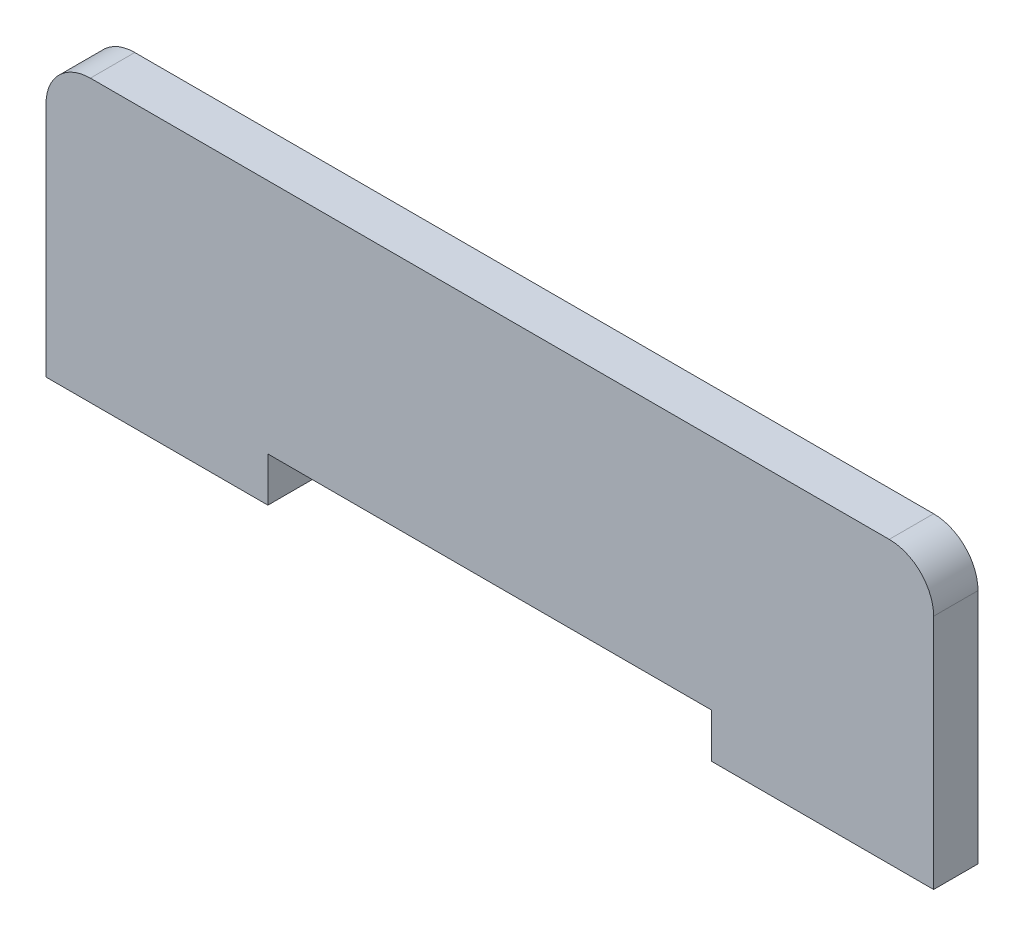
ISO-10303-21;
HEADER;
FILE_DESCRIPTION(('STEP AP214'),'2;1');
FILE_NAME('part.step','',(''),(''),'','','');
FILE_SCHEMA(('AUTOMOTIVE_DESIGN { 1 0 10303 214 1 1 1 1 }'));
ENDSEC;
DATA;
#1=APPLICATION_CONTEXT('core data for automotive mechanical design processes');
#2=APPLICATION_PROTOCOL_DEFINITION('international standard','automotive_design',2000,#1);
#3=PRODUCT_CONTEXT('',#1,'mechanical');
#4=PRODUCT('Part','Part','',(#3));
#5=PRODUCT_RELATED_PRODUCT_CATEGORY('part','',(#4));
#6=PRODUCT_DEFINITION_FORMATION('','',#4);
#7=PRODUCT_DEFINITION_CONTEXT('part definition',#1,'design');
#8=PRODUCT_DEFINITION('design','',#6,#7);
#9=PRODUCT_DEFINITION_SHAPE('','',#8);
#10=(LENGTH_UNIT() NAMED_UNIT(*) SI_UNIT(.MILLI.,.METRE.));
#11=(NAMED_UNIT(*) PLANE_ANGLE_UNIT() SI_UNIT($,.RADIAN.));
#12=(NAMED_UNIT(*) SI_UNIT($,.STERADIAN.) SOLID_ANGLE_UNIT());
#13=UNCERTAINTY_MEASURE_WITH_UNIT(LENGTH_MEASURE(1.E-05),#10,'distance_accuracy_value','');
#14=(GEOMETRIC_REPRESENTATION_CONTEXT(3) GLOBAL_UNCERTAINTY_ASSIGNED_CONTEXT((#13)) GLOBAL_UNIT_ASSIGNED_CONTEXT((#10,
#11,#12)) REPRESENTATION_CONTEXT('',''));
#15=CARTESIAN_POINT('',(0.,0.,0.));
#16=DIRECTION('',(0.,0.,1.));
#17=DIRECTION('',(1.,0.,0.));
#18=AXIS2_PLACEMENT_3D('',#15,#16,#17);
#19=CARTESIAN_POINT('',(0.,0.,3.));
#20=DIRECTION('',(0.,1.,0.));
#21=DIRECTION('',(0.,0.,1.));
#22=AXIS2_PLACEMENT_3D('',#19,#20,#21);
#23=PLANE('',#22);
#24=DIRECTION('',(1.,0.,0.));
#25=VECTOR('',#24,1.);
#26=CARTESIAN_POINT('',(0.,0.,0.));
#27=LINE('',#26,#25);
#28=CARTESIAN_POINT('',(0.,0.,0.));
#29=VERTEX_POINT('',#28);
#30=CARTESIAN_POINT('',(15.,0.,0.));
#31=VERTEX_POINT('',#30);
#32=EDGE_CURVE('E201',#29,#31,#27,.T.);
#33=ORIENTED_EDGE('',*,*,#32,.T.);
#34=DIRECTION('',(0.,0.,-1.));
#35=VECTOR('',#34,1.);
#36=CARTESIAN_POINT('',(15.,0.,3.));
#37=LINE('',#36,#35);
#38=CARTESIAN_POINT('',(15.,0.,3.));
#39=VERTEX_POINT('',#38);
#40=EDGE_CURVE('E135',#39,#31,#37,.T.);
#41=ORIENTED_EDGE('',*,*,#40,.F.);
#42=DIRECTION('',(1.,0.,0.));
#43=VECTOR('',#42,1.);
#44=CARTESIAN_POINT('',(0.,0.,3.));
#45=LINE('',#44,#43);
#46=CARTESIAN_POINT('',(0.,0.,3.));
#47=VERTEX_POINT('',#46);
#48=EDGE_CURVE('E123',#47,#39,#45,.T.);
#49=ORIENTED_EDGE('',*,*,#48,.F.);
#50=DIRECTION('',(0.,0.,-1.));
#51=VECTOR('',#50,1.);
#52=CARTESIAN_POINT('',(0.,0.,3.));
#53=LINE('',#52,#51);
#54=EDGE_CURVE('E133',#47,#29,#53,.T.);
#55=ORIENTED_EDGE('',*,*,#54,.T.);
#56=EDGE_LOOP('',(#33,#41,#49,#55));
#57=FACE_BOUND('',#56,.T.);
#58=ADVANCED_FACE('F42',(#57),#23,.F.);
#59=CARTESIAN_POINT('',(15.,0.,3.));
#60=DIRECTION('',(-1.,0.,0.));
#61=DIRECTION('',(0.,0.,1.));
#62=AXIS2_PLACEMENT_3D('',#59,#60,#61);
#63=PLANE('',#62);
#64=DIRECTION('',(0.,1.,0.));
#65=VECTOR('',#64,1.);
#66=CARTESIAN_POINT('',(15.,0.,0.));
#67=LINE('',#66,#65);
#68=CARTESIAN_POINT('',(15.,3.,0.));
#69=VERTEX_POINT('',#68);
#70=EDGE_CURVE('E204',#31,#69,#67,.T.);
#71=ORIENTED_EDGE('',*,*,#70,.T.);
#72=DIRECTION('',(0.,0.,-1.));
#73=VECTOR('',#72,1.);
#74=CARTESIAN_POINT('',(15.,3.,3.));
#75=LINE('',#74,#73);
#76=CARTESIAN_POINT('',(15.,3.,3.));
#77=VERTEX_POINT('',#76);
#78=EDGE_CURVE('E150',#77,#69,#75,.T.);
#79=ORIENTED_EDGE('',*,*,#78,.F.);
#80=DIRECTION('',(0.,1.,0.));
#81=VECTOR('',#80,1.);
#82=CARTESIAN_POINT('',(15.,0.,3.));
#83=LINE('',#82,#81);
#84=EDGE_CURVE('E138',#39,#77,#83,.T.);
#85=ORIENTED_EDGE('',*,*,#84,.F.);
#86=ORIENTED_EDGE('',*,*,#40,.T.);
#87=EDGE_LOOP('',(#71,#79,#85,#86));
#88=FACE_BOUND('',#87,.T.);
#89=ADVANCED_FACE('F261',(#88),#63,.F.);
#90=CARTESIAN_POINT('',(15.,3.,3.));
#91=DIRECTION('',(0.,1.,0.));
#92=DIRECTION('',(0.,0.,1.));
#93=AXIS2_PLACEMENT_3D('',#90,#91,#92);
#94=PLANE('',#93);
#95=DIRECTION('',(1.,0.,0.));
#96=VECTOR('',#95,1.);
#97=CARTESIAN_POINT('',(15.,3.,0.));
#98=LINE('',#97,#96);
#99=CARTESIAN_POINT('',(45.,3.,0.));
#100=VERTEX_POINT('',#99);
#101=EDGE_CURVE('E207',#69,#100,#98,.T.);
#102=ORIENTED_EDGE('',*,*,#101,.T.);
#103=DIRECTION('',(0.,0.,-1.));
#104=VECTOR('',#103,1.);
#105=CARTESIAN_POINT('',(45.,3.,3.));
#106=LINE('',#105,#104);
#107=CARTESIAN_POINT('',(45.,3.,3.));
#108=VERTEX_POINT('',#107);
#109=EDGE_CURVE('E233',#108,#100,#106,.T.);
#110=ORIENTED_EDGE('',*,*,#109,.F.);
#111=DIRECTION('',(1.,0.,0.));
#112=VECTOR('',#111,1.);
#113=CARTESIAN_POINT('',(15.,3.,3.));
#114=LINE('',#113,#112);
#115=EDGE_CURVE('E181',#77,#108,#114,.T.);
#116=ORIENTED_EDGE('',*,*,#115,.F.);
#117=ORIENTED_EDGE('',*,*,#78,.T.);
#118=EDGE_LOOP('',(#102,#110,#116,#117));
#119=FACE_BOUND('',#118,.T.);
#120=ADVANCED_FACE('F242',(#119),#94,.F.);
#121=CARTESIAN_POINT('',(45.,3.,3.));
#122=DIRECTION('',(1.,0.,0.));
#123=DIRECTION('',(0.,0.,-1.));
#124=AXIS2_PLACEMENT_3D('',#121,#122,#123);
#125=PLANE('',#124);
#126=DIRECTION('',(0.,-1.,0.));
#127=VECTOR('',#126,1.);
#128=CARTESIAN_POINT('',(45.,3.,0.));
#129=LINE('',#128,#127);
#130=CARTESIAN_POINT('',(45.,0.,0.));
#131=VERTEX_POINT('',#130);
#132=EDGE_CURVE('E210',#100,#131,#129,.T.);
#133=ORIENTED_EDGE('',*,*,#132,.T.);
#134=DIRECTION('',(0.,0.,-1.));
#135=VECTOR('',#134,1.);
#136=CARTESIAN_POINT('',(45.,0.,3.));
#137=LINE('',#136,#135);
#138=CARTESIAN_POINT('',(45.,0.,3.));
#139=VERTEX_POINT('',#138);
#140=EDGE_CURVE('E229',#139,#131,#137,.T.);
#141=ORIENTED_EDGE('',*,*,#140,.F.);
#142=DIRECTION('',(0.,-1.,0.));
#143=VECTOR('',#142,1.);
#144=CARTESIAN_POINT('',(45.,3.,3.));
#145=LINE('',#144,#143);
#146=EDGE_CURVE('E185',#108,#139,#145,.T.);
#147=ORIENTED_EDGE('',*,*,#146,.F.);
#148=ORIENTED_EDGE('',*,*,#109,.T.);
#149=EDGE_LOOP('',(#133,#141,#147,#148));
#150=FACE_BOUND('',#149,.T.);
#151=ADVANCED_FACE('F253',(#150),#125,.F.);
#152=CARTESIAN_POINT('',(45.,0.,3.));
#153=DIRECTION('',(0.,1.,0.));
#154=DIRECTION('',(-1.,0.,0.));
#155=AXIS2_PLACEMENT_3D('',#152,#153,#154);
#156=PLANE('',#155);
#157=DIRECTION('',(1.,0.,0.));
#158=VECTOR('',#157,1.);
#159=CARTESIAN_POINT('',(45.,0.,0.));
#160=LINE('',#159,#158);
#161=CARTESIAN_POINT('',(60.,0.,0.));
#162=VERTEX_POINT('',#161);
#163=EDGE_CURVE('E213',#131,#162,#160,.T.);
#164=ORIENTED_EDGE('',*,*,#163,.T.);
#165=DIRECTION('',(0.,0.,-1.));
#166=VECTOR('',#165,1.);
#167=CARTESIAN_POINT('',(60.,0.,3.));
#168=LINE('',#167,#166);
#169=CARTESIAN_POINT('',(60.,0.,3.));
#170=VERTEX_POINT('',#169);
#171=EDGE_CURVE('E200',#170,#162,#168,.T.);
#172=ORIENTED_EDGE('',*,*,#171,.F.);
#173=DIRECTION('',(1.,0.,0.));
#174=VECTOR('',#173,1.);
#175=CARTESIAN_POINT('',(45.,0.,3.));
#176=LINE('',#175,#174);
#177=EDGE_CURVE('E188',#139,#170,#176,.T.);
#178=ORIENTED_EDGE('',*,*,#177,.F.);
#179=ORIENTED_EDGE('',*,*,#140,.T.);
#180=EDGE_LOOP('',(#164,#172,#178,#179));
#181=FACE_BOUND('',#180,.T.);
#182=ADVANCED_FACE('F257',(#181),#156,.F.);
#183=CARTESIAN_POINT('',(60.,3.,3.));
#184=DIRECTION('',(-1.,0.,0.));
#185=DIRECTION('',(0.,0.,1.));
#186=AXIS2_PLACEMENT_3D('',#183,#184,#185);
#187=PLANE('',#186);
#188=DIRECTION('',(0.,1.,0.));
#189=VECTOR('',#188,1.);
#190=CARTESIAN_POINT('',(60.,3.,0.));
#191=LINE('',#190,#189);
#192=CARTESIAN_POINT('',(60.,16.,0.));
#193=VERTEX_POINT('',#192);
#194=EDGE_CURVE('E217',#162,#193,#191,.T.);
#195=ORIENTED_EDGE('',*,*,#194,.T.);
#196=DIRECTION('',(0.,0.,-1.));
#197=VECTOR('',#196,1.);
#198=CARTESIAN_POINT('',(60.,16.,3.));
#199=LINE('',#198,#197);
#200=CARTESIAN_POINT('',(60.,16.,3.));
#201=VERTEX_POINT('',#200);
#202=EDGE_CURVE('E66',#193,#201,#199,.F.);
#203=ORIENTED_EDGE('',*,*,#202,.T.);
#204=DIRECTION('',(0.,1.,0.));
#205=VECTOR('',#204,1.);
#206=CARTESIAN_POINT('',(60.,0.,3.));
#207=LINE('',#206,#205);
#208=EDGE_CURVE('E192',#170,#201,#207,.T.);
#209=ORIENTED_EDGE('',*,*,#208,.F.);
#210=ORIENTED_EDGE('',*,*,#171,.T.);
#211=EDGE_LOOP('',(#195,#203,#209,#210));
#212=FACE_BOUND('',#211,.T.);
#213=ADVANCED_FACE('F286',(#212),#187,.F.);
#214=CARTESIAN_POINT('',(60.,19.,3.));
#215=DIRECTION('',(0.,-1.,0.));
#216=DIRECTION('',(1.,0.,0.));
#217=AXIS2_PLACEMENT_3D('',#214,#215,#216);
#218=PLANE('',#217);
#219=DIRECTION('',(-1.,0.,0.));
#220=VECTOR('',#219,1.);
#221=CARTESIAN_POINT('',(60.,19.,3.));
#222=LINE('',#221,#220);
#223=CARTESIAN_POINT('',(57.,19.,3.));
#224=VERTEX_POINT('',#223);
#225=CARTESIAN_POINT('',(3.,19.,3.));
#226=VERTEX_POINT('',#225);
#227=EDGE_CURVE('E195',#224,#226,#222,.T.);
#228=ORIENTED_EDGE('',*,*,#227,.F.);
#229=DIRECTION('',(0.,0.,-1.));
#230=VECTOR('',#229,1.);
#231=CARTESIAN_POINT('',(57.,19.,3.));
#232=LINE('',#231,#230);
#233=CARTESIAN_POINT('',(57.,19.,0.));
#234=VERTEX_POINT('',#233);
#235=EDGE_CURVE('E148',#224,#234,#232,.T.);
#236=ORIENTED_EDGE('',*,*,#235,.T.);
#237=DIRECTION('',(-1.,0.,0.));
#238=VECTOR('',#237,1.);
#239=CARTESIAN_POINT('',(60.,19.,0.));
#240=LINE('',#239,#238);
#241=CARTESIAN_POINT('',(3.,19.,0.));
#242=VERTEX_POINT('',#241);
#243=EDGE_CURVE('E220',#234,#242,#240,.T.);
#244=ORIENTED_EDGE('',*,*,#243,.T.);
#245=DIRECTION('',(0.,0.,-1.));
#246=VECTOR('',#245,1.);
#247=CARTESIAN_POINT('',(3.,19.,3.));
#248=LINE('',#247,#246);
#249=EDGE_CURVE('E144',#242,#226,#248,.F.);
#250=ORIENTED_EDGE('',*,*,#249,.T.);
#251=EDGE_LOOP('',(#228,#236,#244,#250));
#252=FACE_BOUND('',#251,.T.);
#253=ADVANCED_FACE('F284',(#252),#218,.F.);
#254=CARTESIAN_POINT('',(0.,19.,3.));
#255=DIRECTION('',(1.,0.,0.));
#256=DIRECTION('',(0.,1.,0.));
#257=AXIS2_PLACEMENT_3D('',#254,#255,#256);
#258=PLANE('',#257);
#259=DIRECTION('',(0.,-1.,0.));
#260=VECTOR('',#259,1.);
#261=CARTESIAN_POINT('',(0.,3.,3.));
#262=LINE('',#261,#260);
#263=CARTESIAN_POINT('',(0.,16.,3.));
#264=VERTEX_POINT('',#263);
#265=EDGE_CURVE('E120',#264,#47,#262,.T.);
#266=ORIENTED_EDGE('',*,*,#265,.F.);
#267=DIRECTION('',(0.,0.,-1.));
#268=VECTOR('',#267,1.);
#269=CARTESIAN_POINT('',(0.,16.,3.));
#270=LINE('',#269,#268);
#271=CARTESIAN_POINT('',(0.,16.,0.));
#272=VERTEX_POINT('',#271);
#273=EDGE_CURVE('E12',#264,#272,#270,.T.);
#274=ORIENTED_EDGE('',*,*,#273,.T.);
#275=DIRECTION('',(0.,-1.,0.));
#276=VECTOR('',#275,1.);
#277=CARTESIAN_POINT('',(0.,19.,0.));
#278=LINE('',#277,#276);
#279=EDGE_CURVE('E129',#272,#29,#278,.T.);
#280=ORIENTED_EDGE('',*,*,#279,.T.);
#281=ORIENTED_EDGE('',*,*,#54,.F.);
#282=EDGE_LOOP('',(#266,#274,#280,#281));
#283=FACE_BOUND('',#282,.T.);
#284=ADVANCED_FACE('F140',(#283),#258,.F.);
#285=CARTESIAN_POINT('',(0.,0.,3.));
#286=DIRECTION('',(0.,0.,1.));
#287=DIRECTION('',(1.,0.,0.));
#288=AXIS2_PLACEMENT_3D('',#285,#286,#287);
#289=PLANE('',#288);
#290=ORIENTED_EDGE('',*,*,#208,.T.);
#291=CARTESIAN_POINT('',(57.,16.,3.));
#292=DIRECTION('',(0.,0.,1.));
#293=DIRECTION('',(1.,0.,0.));
#294=AXIS2_PLACEMENT_3D('',#291,#292,#293);
#295=CIRCLE('',#294,3.);
#296=EDGE_CURVE('E51',#201,#224,#295,.T.);
#297=ORIENTED_EDGE('',*,*,#296,.T.);
#298=ORIENTED_EDGE('',*,*,#227,.T.);
#299=CARTESIAN_POINT('',(3.,16.,3.));
#300=DIRECTION('',(0.,0.,1.));
#301=DIRECTION('',(1.,0.,0.));
#302=AXIS2_PLACEMENT_3D('',#299,#300,#301);
#303=CIRCLE('',#302,3.);
#304=EDGE_CURVE('E58',#226,#264,#303,.T.);
#305=ORIENTED_EDGE('',*,*,#304,.T.);
#306=ORIENTED_EDGE('',*,*,#265,.T.);
#307=ORIENTED_EDGE('',*,*,#48,.T.);
#308=ORIENTED_EDGE('',*,*,#84,.T.);
#309=ORIENTED_EDGE('',*,*,#115,.T.);
#310=ORIENTED_EDGE('',*,*,#146,.T.);
#311=ORIENTED_EDGE('',*,*,#177,.T.);
#312=EDGE_LOOP('',(#290,#297,#298,#305,#306,#307,#308,#309,#310,#311));
#313=FACE_BOUND('',#312,.T.);
#314=ADVANCED_FACE('F122',(#313),#289,.T.);
#315=CARTESIAN_POINT('',(0.,0.,0.));
#316=DIRECTION('',(0.,0.,1.));
#317=DIRECTION('',(1.,0.,0.));
#318=AXIS2_PLACEMENT_3D('',#315,#316,#317);
#319=PLANE('',#318);
#320=ORIENTED_EDGE('',*,*,#243,.F.);
#321=CARTESIAN_POINT('',(57.,16.,0.));
#322=DIRECTION('',(0.,0.,1.));
#323=DIRECTION('',(1.,0.,0.));
#324=AXIS2_PLACEMENT_3D('',#321,#322,#323);
#325=CIRCLE('',#324,3.);
#326=EDGE_CURVE('E160',#234,#193,#325,.F.);
#327=ORIENTED_EDGE('',*,*,#326,.T.);
#328=ORIENTED_EDGE('',*,*,#194,.F.);
#329=ORIENTED_EDGE('',*,*,#163,.F.);
#330=ORIENTED_EDGE('',*,*,#132,.F.);
#331=ORIENTED_EDGE('',*,*,#101,.F.);
#332=ORIENTED_EDGE('',*,*,#70,.F.);
#333=ORIENTED_EDGE('',*,*,#32,.F.);
#334=ORIENTED_EDGE('',*,*,#279,.F.);
#335=CARTESIAN_POINT('',(3.,16.,0.));
#336=DIRECTION('',(0.,0.,1.));
#337=DIRECTION('',(1.,0.,0.));
#338=AXIS2_PLACEMENT_3D('',#335,#336,#337);
#339=CIRCLE('',#338,3.);
#340=EDGE_CURVE('E157',#272,#242,#339,.F.);
#341=ORIENTED_EDGE('',*,*,#340,.T.);
#342=EDGE_LOOP('',(#320,#327,#328,#329,#330,#331,#332,#333,#334,#341));
#343=FACE_BOUND('',#342,.T.);
#344=ADVANCED_FACE('F249',(#343),#319,.F.);
#345=CARTESIAN_POINT('',(57.,16.,3.));
#346=DIRECTION('',(0.,0.,-1.));
#347=DIRECTION('',(-1.,0.,0.));
#348=AXIS2_PLACEMENT_3D('',#345,#346,#347);
#349=CYLINDRICAL_SURFACE('',#348,3.);
#350=ORIENTED_EDGE('',*,*,#296,.F.);
#351=ORIENTED_EDGE('',*,*,#202,.F.);
#352=ORIENTED_EDGE('',*,*,#326,.F.);
#353=ORIENTED_EDGE('',*,*,#235,.F.);
#354=EDGE_LOOP('',(#350,#351,#352,#353));
#355=FACE_BOUND('',#354,.T.);
#356=ADVANCED_FACE('F271',(#355),#349,.T.);
#357=CARTESIAN_POINT('',(3.,16.,3.));
#358=DIRECTION('',(0.,0.,-1.));
#359=DIRECTION('',(-1.,0.,0.));
#360=AXIS2_PLACEMENT_3D('',#357,#358,#359);
#361=CYLINDRICAL_SURFACE('',#360,3.);
#362=ORIENTED_EDGE('',*,*,#304,.F.);
#363=ORIENTED_EDGE('',*,*,#249,.F.);
#364=ORIENTED_EDGE('',*,*,#340,.F.);
#365=ORIENTED_EDGE('',*,*,#273,.F.);
#366=EDGE_LOOP('',(#362,#363,#364,#365));
#367=FACE_BOUND('',#366,.T.);
#368=ADVANCED_FACE('F44',(#367),#361,.T.);
#369=CLOSED_SHELL('',(#58,#89,#120,#151,#182,#213,#253,#284,#314,#344,#356,#368));
#370=MANIFOLD_SOLID_BREP('B2',#369);
#371=ADVANCED_BREP_SHAPE_REPRESENTATION('',(#18,#370),#14);
#372=SHAPE_DEFINITION_REPRESENTATION(#9,#371);
ENDSEC;
END-ISO-10303-21;
